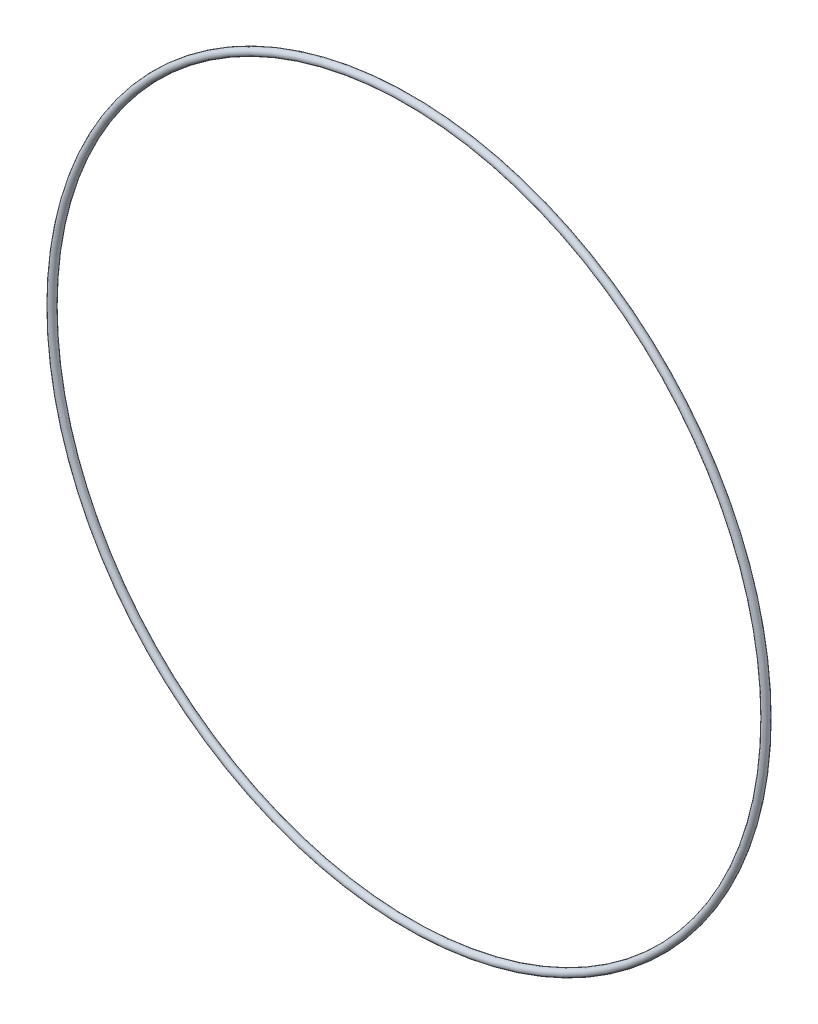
ISO-10303-21;
HEADER;
FILE_DESCRIPTION(('STEP AP214'),'2;1');
FILE_NAME('part.step','',(''),(''),'','','');
FILE_SCHEMA(('AUTOMOTIVE_DESIGN { 1 0 10303 214 1 1 1 1 }'));
ENDSEC;
DATA;
#1=APPLICATION_CONTEXT('core data for automotive mechanical design processes');
#2=APPLICATION_PROTOCOL_DEFINITION('international standard','automotive_design',2000,#1);
#3=PRODUCT_CONTEXT('',#1,'mechanical');
#4=PRODUCT('Part','Part','',(#3));
#5=PRODUCT_RELATED_PRODUCT_CATEGORY('part','',(#4));
#6=PRODUCT_DEFINITION_FORMATION('','',#4);
#7=PRODUCT_DEFINITION_CONTEXT('part definition',#1,'design');
#8=PRODUCT_DEFINITION('design','',#6,#7);
#9=PRODUCT_DEFINITION_SHAPE('','',#8);
#10=(LENGTH_UNIT() NAMED_UNIT(*) SI_UNIT(.MILLI.,.METRE.));
#11=(NAMED_UNIT(*) PLANE_ANGLE_UNIT() SI_UNIT($,.RADIAN.));
#12=(NAMED_UNIT(*) SI_UNIT($,.STERADIAN.) SOLID_ANGLE_UNIT());
#13=UNCERTAINTY_MEASURE_WITH_UNIT(LENGTH_MEASURE(1.E-05),#10,'distance_accuracy_value','');
#14=(GEOMETRIC_REPRESENTATION_CONTEXT(3) GLOBAL_UNCERTAINTY_ASSIGNED_CONTEXT((#13)) GLOBAL_UNIT_ASSIGNED_CONTEXT((#10,
#11,#12)) REPRESENTATION_CONTEXT('',''));
#15=CARTESIAN_POINT('',(0.,0.,0.));
#16=DIRECTION('',(0.,0.,1.));
#17=DIRECTION('',(1.,0.,0.));
#18=AXIS2_PLACEMENT_3D('',#15,#16,#17);
#19=CARTESIAN_POINT('',(0.,0.,0.));
#20=DIRECTION('',(0.,0.,-1.));
#21=DIRECTION('',(-1.,0.,0.));
#22=AXIS2_PLACEMENT_3D('',#19,#20,#21);
#23=TOROIDAL_SURFACE('',#22,147.,1.5);
#24=CARTESIAN_POINT('',(-148.5,0.,0.));
#25=VERTEX_POINT('',#24);
#26=VERTEX_LOOP('',#25);
#27=FACE_BOUND('',#26,.T.);
#28=ADVANCED_FACE('F32',(#27),#23,.T.);
#29=CLOSED_SHELL('',(#28));
#30=MANIFOLD_SOLID_BREP('B2',#29);
#31=ADVANCED_BREP_SHAPE_REPRESENTATION('',(#18,#30),#14);
#32=SHAPE_DEFINITION_REPRESENTATION(#9,#31);
ENDSEC;
END-ISO-10303-21;
